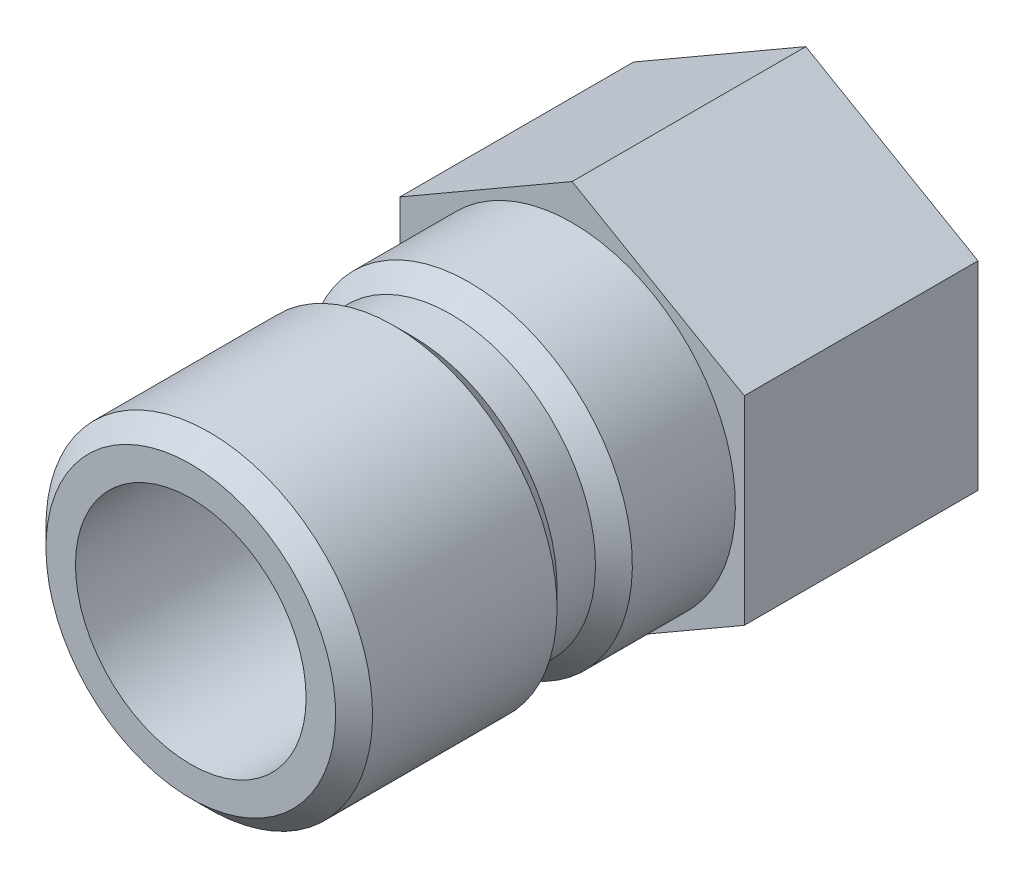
ISO-10303-21;
HEADER;
FILE_DESCRIPTION(('STEP AP214'),'2;1');
FILE_NAME('part.step','',(''),(''),'','','');
FILE_SCHEMA(('AUTOMOTIVE_DESIGN { 1 0 10303 214 1 1 1 1 }'));
ENDSEC;
DATA;
#1=APPLICATION_CONTEXT('core data for automotive mechanical design processes');
#2=APPLICATION_PROTOCOL_DEFINITION('international standard','automotive_design',2000,#1);
#3=PRODUCT_CONTEXT('',#1,'mechanical');
#4=PRODUCT('Part','Part','',(#3));
#5=PRODUCT_RELATED_PRODUCT_CATEGORY('part','',(#4));
#6=PRODUCT_DEFINITION_FORMATION('','',#4);
#7=PRODUCT_DEFINITION_CONTEXT('part definition',#1,'design');
#8=PRODUCT_DEFINITION('design','',#6,#7);
#9=PRODUCT_DEFINITION_SHAPE('','',#8);
#10=(LENGTH_UNIT() NAMED_UNIT(*) SI_UNIT(.MILLI.,.METRE.));
#11=(NAMED_UNIT(*) PLANE_ANGLE_UNIT() SI_UNIT($,.RADIAN.));
#12=(NAMED_UNIT(*) SI_UNIT($,.STERADIAN.) SOLID_ANGLE_UNIT());
#13=UNCERTAINTY_MEASURE_WITH_UNIT(LENGTH_MEASURE(1.E-05),#10,'distance_accuracy_value','');
#14=(GEOMETRIC_REPRESENTATION_CONTEXT(3) GLOBAL_UNCERTAINTY_ASSIGNED_CONTEXT((#13)) GLOBAL_UNIT_ASSIGNED_CONTEXT((#10,
#11,#12)) REPRESENTATION_CONTEXT('',''));
#15=CARTESIAN_POINT('',(0.,0.,0.));
#16=DIRECTION('',(0.,0.,1.));
#17=DIRECTION('',(1.,0.,0.));
#18=AXIS2_PLACEMENT_3D('',#15,#16,#17);
#19=CARTESIAN_POINT('',(0.,6.7437,0.));
#20=DIRECTION('',(0.,0.,1.));
#21=DIRECTION('',(0.,-1.,0.));
#22=AXIS2_PLACEMENT_3D('',#19,#20,#21);
#23=PLANE('',#22);
#24=CARTESIAN_POINT('',(0.,0.,0.));
#25=DIRECTION('',(0.,0.,-1.));
#26=DIRECTION('',(0.,1.,0.));
#27=AXIS2_PLACEMENT_3D('',#24,#25,#26);
#28=CIRCLE('',#27,6.7437);
#29=CARTESIAN_POINT('',(0.,6.7437,0.));
#30=VERTEX_POINT('',#29);
#31=EDGE_CURVE('E148',#30,#30,#28,.T.);
#32=ORIENTED_EDGE('',*,*,#31,.T.);
#33=EDGE_LOOP('',(#32));
#34=FACE_BOUND('',#33,.T.);
#35=DIRECTION('',(-0.866025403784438,0.5,0.));
#36=VECTOR('',#35,1.);
#37=CARTESIAN_POINT('',(7.112,4.10611511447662,0.));
#38=LINE('',#37,#36);
#39=CARTESIAN_POINT('',(7.112,4.10611511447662,0.));
#40=VERTEX_POINT('',#39);
#41=CARTESIAN_POINT('',(0.,8.21223022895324,0.));
#42=VERTEX_POINT('',#41);
#43=EDGE_CURVE('E129',#40,#42,#38,.T.);
#44=ORIENTED_EDGE('',*,*,#43,.T.);
#45=DIRECTION('',(-0.866025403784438,-0.5,0.));
#46=VECTOR('',#45,1.);
#47=CARTESIAN_POINT('',(0.,8.21223022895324,0.));
#48=LINE('',#47,#46);
#49=CARTESIAN_POINT('',(-7.112,4.10611511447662,0.));
#50=VERTEX_POINT('',#49);
#51=EDGE_CURVE('E118',#42,#50,#48,.T.);
#52=ORIENTED_EDGE('',*,*,#51,.T.);
#53=DIRECTION('',(0.,-1.,0.));
#54=VECTOR('',#53,1.);
#55=CARTESIAN_POINT('',(-7.112,4.10611511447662,0.));
#56=LINE('',#55,#54);
#57=CARTESIAN_POINT('',(-7.112,-4.10611511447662,0.));
#58=VERTEX_POINT('',#57);
#59=EDGE_CURVE('E121',#50,#58,#56,.T.);
#60=ORIENTED_EDGE('',*,*,#59,.T.);
#61=DIRECTION('',(0.866025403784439,-0.5,0.));
#62=VECTOR('',#61,1.);
#63=CARTESIAN_POINT('',(-7.112,-4.10611511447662,0.));
#64=LINE('',#63,#62);
#65=CARTESIAN_POINT('',(0.,-8.21223022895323,0.));
#66=VERTEX_POINT('',#65);
#67=EDGE_CURVE('E49',#58,#66,#64,.T.);
#68=ORIENTED_EDGE('',*,*,#67,.T.);
#69=DIRECTION('',(0.866025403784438,0.5,0.));
#70=VECTOR('',#69,1.);
#71=CARTESIAN_POINT('',(0.,-8.21223022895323,0.));
#72=LINE('',#71,#70);
#73=CARTESIAN_POINT('',(7.112,-4.10611511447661,0.));
#74=VERTEX_POINT('',#73);
#75=EDGE_CURVE('E94',#66,#74,#72,.T.);
#76=ORIENTED_EDGE('',*,*,#75,.T.);
#77=DIRECTION('',(0.,1.,0.));
#78=VECTOR('',#77,1.);
#79=CARTESIAN_POINT('',(7.112,-4.10611511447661,0.));
#80=LINE('',#79,#78);
#81=EDGE_CURVE('E126',#74,#40,#80,.T.);
#82=ORIENTED_EDGE('',*,*,#81,.T.);
#83=EDGE_LOOP('',(#44,#52,#60,#68,#76,#82));
#84=FACE_BOUND('',#83,.T.);
#85=ADVANCED_FACE('F34',(#34,#84),#23,.T.);
#86=CARTESIAN_POINT('',(0.,8.73125,-9.652));
#87=DIRECTION('',(0.,0.,-1.));
#88=DIRECTION('',(0.,1.,0.));
#89=AXIS2_PLACEMENT_3D('',#86,#87,#88);
#90=PLANE('',#89);
#91=CARTESIAN_POINT('',(0.,0.,-9.652));
#92=DIRECTION('',(0.,0.,-1.));
#93=DIRECTION('',(0.,1.,0.));
#94=AXIS2_PLACEMENT_3D('',#91,#92,#93);
#95=CIRCLE('',#94,4.55334540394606);
#96=CARTESIAN_POINT('',(0.,4.55334540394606,-9.652));
#97=VERTEX_POINT('',#96);
#98=EDGE_CURVE('E145',#97,#97,#95,.T.);
#99=ORIENTED_EDGE('',*,*,#98,.F.);
#100=EDGE_LOOP('',(#99));
#101=FACE_BOUND('',#100,.T.);
#102=DIRECTION('',(0.,-1.,0.));
#103=VECTOR('',#102,1.);
#104=CARTESIAN_POINT('',(-7.112,4.10611511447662,-9.652));
#105=LINE('',#104,#103);
#106=CARTESIAN_POINT('',(-7.112,4.10611511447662,-9.652));
#107=VERTEX_POINT('',#106);
#108=CARTESIAN_POINT('',(-7.112,-4.10611511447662,-9.652));
#109=VERTEX_POINT('',#108);
#110=EDGE_CURVE('E104',#107,#109,#105,.T.);
#111=ORIENTED_EDGE('',*,*,#110,.F.);
#112=DIRECTION('',(-0.866025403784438,-0.5,0.));
#113=VECTOR('',#112,1.);
#114=CARTESIAN_POINT('',(0.,8.21223022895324,-9.652));
#115=LINE('',#114,#113);
#116=CARTESIAN_POINT('',(0.,8.21223022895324,-9.652));
#117=VERTEX_POINT('',#116);
#118=EDGE_CURVE('E57',#117,#107,#115,.T.);
#119=ORIENTED_EDGE('',*,*,#118,.F.);
#120=DIRECTION('',(-0.866025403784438,0.5,0.));
#121=VECTOR('',#120,1.);
#122=CARTESIAN_POINT('',(7.112,4.10611511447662,-9.652));
#123=LINE('',#122,#121);
#124=CARTESIAN_POINT('',(7.112,4.10611511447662,-9.652));
#125=VERTEX_POINT('',#124);
#126=EDGE_CURVE('E111',#125,#117,#123,.T.);
#127=ORIENTED_EDGE('',*,*,#126,.F.);
#128=DIRECTION('',(0.,1.,0.));
#129=VECTOR('',#128,1.);
#130=CARTESIAN_POINT('',(7.112,-4.10611511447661,-9.652));
#131=LINE('',#130,#129);
#132=CARTESIAN_POINT('',(7.112,-4.10611511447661,-9.652));
#133=VERTEX_POINT('',#132);
#134=EDGE_CURVE('E109',#133,#125,#131,.T.);
#135=ORIENTED_EDGE('',*,*,#134,.F.);
#136=DIRECTION('',(0.866025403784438,0.5,0.));
#137=VECTOR('',#136,1.);
#138=CARTESIAN_POINT('',(0.,-8.21223022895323,-9.652));
#139=LINE('',#138,#137);
#140=CARTESIAN_POINT('',(0.,-8.21223022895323,-9.652));
#141=VERTEX_POINT('',#140);
#142=EDGE_CURVE('E91',#141,#133,#139,.T.);
#143=ORIENTED_EDGE('',*,*,#142,.F.);
#144=DIRECTION('',(0.866025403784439,-0.5,0.));
#145=VECTOR('',#144,1.);
#146=CARTESIAN_POINT('',(-7.112,-4.10611511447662,-9.652));
#147=LINE('',#146,#145);
#148=EDGE_CURVE('E99',#109,#141,#147,.T.);
#149=ORIENTED_EDGE('',*,*,#148,.F.);
#150=EDGE_LOOP('',(#111,#119,#127,#135,#143,#149));
#151=FACE_BOUND('',#150,.T.);
#152=ADVANCED_FACE('F106',(#101,#151),#90,.T.);
#153=CARTESIAN_POINT('',(0.,0.,0.));
#154=DIRECTION('',(0.,0.,-1.));
#155=DIRECTION('',(0.,1.,0.));
#156=AXIS2_PLACEMENT_3D('',#153,#154,#155);
#157=CYLINDRICAL_SURFACE('',#156,4.7625);
#158=CARTESIAN_POINT('',(0.,0.,-1.7145));
#159=DIRECTION('',(0.,0.,-1.));
#160=DIRECTION('',(0.,1.,0.));
#161=AXIS2_PLACEMENT_3D('',#158,#159,#160);
#162=CIRCLE('',#161,4.7625);
#163=CARTESIAN_POINT('',(0.,4.7625,-1.7145));
#164=VERTEX_POINT('',#163);
#165=EDGE_CURVE('E134',#164,#164,#162,.T.);
#166=ORIENTED_EDGE('',*,*,#165,.T.);
#167=EDGE_LOOP('',(#166));
#168=FACE_BOUND('',#167,.T.);
#169=CARTESIAN_POINT('',(0.,0.,15.748));
#170=DIRECTION('',(0.,0.,-1.));
#171=DIRECTION('',(0.,1.,0.));
#172=AXIS2_PLACEMENT_3D('',#169,#170,#171);
#173=CIRCLE('',#172,4.7625);
#174=CARTESIAN_POINT('',(0.,4.7625,15.748));
#175=VERTEX_POINT('',#174);
#176=EDGE_CURVE('E12',#175,#175,#173,.T.);
#177=ORIENTED_EDGE('',*,*,#176,.F.);
#178=EDGE_LOOP('',(#177));
#179=FACE_BOUND('',#178,.T.);
#180=ADVANCED_FACE('F36',(#168,#179),#157,.F.);
#181=CARTESIAN_POINT('',(0.,4.7625,15.748));
#182=DIRECTION('',(0.,0.,1.));
#183=DIRECTION('',(0.,-1.,0.));
#184=AXIS2_PLACEMENT_3D('',#181,#182,#183);
#185=PLANE('',#184);
#186=ORIENTED_EDGE('',*,*,#176,.T.);
#187=EDGE_LOOP('',(#186));
#188=FACE_BOUND('',#187,.T.);
#189=CARTESIAN_POINT('',(0.,0.,15.748));
#190=DIRECTION('',(0.,0.,-1.));
#191=DIRECTION('',(0.,1.,0.));
#192=AXIS2_PLACEMENT_3D('',#189,#190,#191);
#193=CIRCLE('',#192,5.9817);
#194=CARTESIAN_POINT('',(0.,5.9817,15.748));
#195=VERTEX_POINT('',#194);
#196=EDGE_CURVE('E42',#195,#195,#193,.T.);
#197=ORIENTED_EDGE('',*,*,#196,.F.);
#198=EDGE_LOOP('',(#197));
#199=FACE_BOUND('',#198,.T.);
#200=ADVANCED_FACE('F171',(#188,#199),#185,.T.);
#201=CARTESIAN_POINT('',(0.,0.,14.986));
#202=DIRECTION('',(0.,0.,-1.));
#203=DIRECTION('',(0.,1.,0.));
#204=AXIS2_PLACEMENT_3D('',#201,#202,#203);
#205=CONICAL_SURFACE('',#204,6.7437,0.785398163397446);
#206=ORIENTED_EDGE('',*,*,#196,.T.);
#207=EDGE_LOOP('',(#206));
#208=FACE_BOUND('',#207,.T.);
#209=CARTESIAN_POINT('',(0.,0.,14.986));
#210=DIRECTION('',(0.,0.,-1.));
#211=DIRECTION('',(0.,1.,0.));
#212=AXIS2_PLACEMENT_3D('',#209,#210,#211);
#213=CIRCLE('',#212,6.7437);
#214=CARTESIAN_POINT('',(0.,6.7437,14.986));
#215=VERTEX_POINT('',#214);
#216=EDGE_CURVE('E163',#215,#215,#213,.T.);
#217=ORIENTED_EDGE('',*,*,#216,.F.);
#218=EDGE_LOOP('',(#217));
#219=FACE_BOUND('',#218,.T.);
#220=ADVANCED_FACE('F168',(#208,#219),#205,.T.);
#221=CARTESIAN_POINT('',(0.,0.,0.));
#222=DIRECTION('',(0.,0.,-1.));
#223=DIRECTION('',(0.,1.,0.));
#224=AXIS2_PLACEMENT_3D('',#221,#222,#223);
#225=CYLINDRICAL_SURFACE('',#224,6.7437);
#226=ORIENTED_EDGE('',*,*,#216,.T.);
#227=EDGE_LOOP('',(#226));
#228=FACE_BOUND('',#227,.T.);
#229=CARTESIAN_POINT('',(0.,0.,7.366));
#230=DIRECTION('',(0.,0.,-1.));
#231=DIRECTION('',(0.,1.,0.));
#232=AXIS2_PLACEMENT_3D('',#229,#230,#231);
#233=CIRCLE('',#232,6.7437);
#234=CARTESIAN_POINT('',(0.,6.7437,7.366));
#235=VERTEX_POINT('',#234);
#236=EDGE_CURVE('E160',#235,#235,#233,.T.);
#237=ORIENTED_EDGE('',*,*,#236,.F.);
#238=EDGE_LOOP('',(#237));
#239=FACE_BOUND('',#238,.T.);
#240=ADVANCED_FACE('F178',(#228,#239),#225,.T.);
#241=CARTESIAN_POINT('',(0.,0.,6.604));
#242=DIRECTION('',(0.,0.,1.));
#243=DIRECTION('',(0.,-1.,0.));
#244=AXIS2_PLACEMENT_3D('',#241,#242,#243);
#245=CONICAL_SURFACE('',#244,5.9817,0.785398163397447);
#246=ORIENTED_EDGE('',*,*,#236,.T.);
#247=EDGE_LOOP('',(#246));
#248=FACE_BOUND('',#247,.T.);
#249=CARTESIAN_POINT('',(0.,0.,6.604));
#250=DIRECTION('',(0.,0.,-1.));
#251=DIRECTION('',(0.,1.,0.));
#252=AXIS2_PLACEMENT_3D('',#249,#250,#251);
#253=CIRCLE('',#252,5.9817);
#254=CARTESIAN_POINT('',(0.,5.9817,6.604));
#255=VERTEX_POINT('',#254);
#256=EDGE_CURVE('E157',#255,#255,#253,.T.);
#257=ORIENTED_EDGE('',*,*,#256,.F.);
#258=EDGE_LOOP('',(#257));
#259=FACE_BOUND('',#258,.T.);
#260=ADVANCED_FACE('F204',(#248,#259),#245,.T.);
#261=CARTESIAN_POINT('',(0.,0.,0.));
#262=DIRECTION('',(0.,0.,-1.));
#263=DIRECTION('',(0.,1.,0.));
#264=AXIS2_PLACEMENT_3D('',#261,#262,#263);
#265=CYLINDRICAL_SURFACE('',#264,5.9817);
#266=ORIENTED_EDGE('',*,*,#256,.T.);
#267=EDGE_LOOP('',(#266));
#268=FACE_BOUND('',#267,.T.);
#269=CARTESIAN_POINT('',(0.,0.,5.0165));
#270=DIRECTION('',(0.,0.,-1.));
#271=DIRECTION('',(0.,1.,0.));
#272=AXIS2_PLACEMENT_3D('',#269,#270,#271);
#273=CIRCLE('',#272,5.9817);
#274=CARTESIAN_POINT('',(0.,5.9817,5.0165));
#275=VERTEX_POINT('',#274);
#276=EDGE_CURVE('E154',#275,#275,#273,.T.);
#277=ORIENTED_EDGE('',*,*,#276,.F.);
#278=EDGE_LOOP('',(#277));
#279=FACE_BOUND('',#278,.T.);
#280=ADVANCED_FACE('F200',(#268,#279),#265,.T.);
#281=CARTESIAN_POINT('',(0.,0.,4.25449999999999));
#282=DIRECTION('',(0.,0.,-1.));
#283=DIRECTION('',(0.,1.,0.));
#284=AXIS2_PLACEMENT_3D('',#281,#282,#283);
#285=CONICAL_SURFACE('',#284,6.7437,0.785398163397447);
#286=ORIENTED_EDGE('',*,*,#276,.T.);
#287=EDGE_LOOP('',(#286));
#288=FACE_BOUND('',#287,.T.);
#289=CARTESIAN_POINT('',(0.,0.,4.25449999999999));
#290=DIRECTION('',(0.,0.,-1.));
#291=DIRECTION('',(0.,1.,0.));
#292=AXIS2_PLACEMENT_3D('',#289,#290,#291);
#293=CIRCLE('',#292,6.7437);
#294=CARTESIAN_POINT('',(0.,6.7437,4.25449999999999));
#295=VERTEX_POINT('',#294);
#296=EDGE_CURVE('E151',#295,#295,#293,.T.);
#297=ORIENTED_EDGE('',*,*,#296,.F.);
#298=EDGE_LOOP('',(#297));
#299=FACE_BOUND('',#298,.T.);
#300=ADVANCED_FACE('F196',(#288,#299),#285,.T.);
#301=CARTESIAN_POINT('',(0.,0.,0.));
#302=DIRECTION('',(0.,0.,-1.));
#303=DIRECTION('',(0.,1.,0.));
#304=AXIS2_PLACEMENT_3D('',#301,#302,#303);
#305=CYLINDRICAL_SURFACE('',#304,6.7437);
#306=ORIENTED_EDGE('',*,*,#296,.T.);
#307=EDGE_LOOP('',(#306));
#308=FACE_BOUND('',#307,.T.);
#309=ORIENTED_EDGE('',*,*,#31,.F.);
#310=EDGE_LOOP('',(#309));
#311=FACE_BOUND('',#310,.T.);
#312=ADVANCED_FACE('F192',(#308,#311),#305,.T.);
#313=CARTESIAN_POINT('',(0.,0.,-1.7145));
#314=DIRECTION('',(0.,0.,-1.));
#315=DIRECTION('',(0.,1.,0.));
#316=AXIS2_PLACEMENT_3D('',#313,#314,#315);
#317=CONICAL_SURFACE('',#316,4.3053,0.0312396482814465);
#318=ORIENTED_EDGE('',*,*,#98,.T.);
#319=EDGE_LOOP('',(#318));
#320=FACE_BOUND('',#319,.T.);
#321=CARTESIAN_POINT('',(0.,0.,-1.7145));
#322=DIRECTION('',(0.,0.,-1.));
#323=DIRECTION('',(0.,1.,0.));
#324=AXIS2_PLACEMENT_3D('',#321,#322,#323);
#325=CIRCLE('',#324,4.3053);
#326=CARTESIAN_POINT('',(0.,4.3053,-1.7145));
#327=VERTEX_POINT('',#326);
#328=EDGE_CURVE('E142',#327,#327,#325,.T.);
#329=ORIENTED_EDGE('',*,*,#328,.F.);
#330=EDGE_LOOP('',(#329));
#331=FACE_BOUND('',#330,.T.);
#332=ADVANCED_FACE('F195',(#320,#331),#317,.F.);
#333=CARTESIAN_POINT('',(0.,4.7625,-1.7145));
#334=DIRECTION('',(0.,0.,1.));
#335=DIRECTION('',(0.,-1.,0.));
#336=AXIS2_PLACEMENT_3D('',#333,#334,#335);
#337=PLANE('',#336);
#338=ORIENTED_EDGE('',*,*,#328,.T.);
#339=EDGE_LOOP('',(#338));
#340=FACE_BOUND('',#339,.T.);
#341=ORIENTED_EDGE('',*,*,#165,.F.);
#342=EDGE_LOOP('',(#341));
#343=FACE_BOUND('',#342,.T.);
#344=ADVANCED_FACE('F248',(#340,#343),#337,.T.);
#345=CARTESIAN_POINT('',(0.,8.21223022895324,-9.652));
#346=DIRECTION('',(-0.5,0.866025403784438,0.));
#347=DIRECTION('',(-0.866025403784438,-0.5,0.));
#348=AXIS2_PLACEMENT_3D('',#345,#346,#347);
#349=PLANE('',#348);
#350=ORIENTED_EDGE('',*,*,#51,.F.);
#351=DIRECTION('',(0.,0.,1.));
#352=VECTOR('',#351,1.);
#353=CARTESIAN_POINT('',(0.,8.21223022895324,-9.652));
#354=LINE('',#353,#352);
#355=EDGE_CURVE('E132',#117,#42,#354,.T.);
#356=ORIENTED_EDGE('',*,*,#355,.F.);
#357=ORIENTED_EDGE('',*,*,#118,.T.);
#358=DIRECTION('',(0.,0.,1.));
#359=VECTOR('',#358,1.);
#360=CARTESIAN_POINT('',(-7.112,4.10611511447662,-9.652));
#361=LINE('',#360,#359);
#362=EDGE_CURVE('E117',#107,#50,#361,.T.);
#363=ORIENTED_EDGE('',*,*,#362,.T.);
#364=EDGE_LOOP('',(#350,#356,#357,#363));
#365=FACE_BOUND('',#364,.T.);
#366=ADVANCED_FACE('F255',(#365),#349,.T.);
#367=CARTESIAN_POINT('',(7.112,4.10611511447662,-9.652));
#368=DIRECTION('',(0.5,0.866025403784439,0.));
#369=DIRECTION('',(-0.866025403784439,0.5,0.));
#370=AXIS2_PLACEMENT_3D('',#367,#368,#369);
#371=PLANE('',#370);
#372=ORIENTED_EDGE('',*,*,#43,.F.);
#373=DIRECTION('',(0.,0.,1.));
#374=VECTOR('',#373,1.);
#375=CARTESIAN_POINT('',(7.112,4.10611511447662,-9.652));
#376=LINE('',#375,#374);
#377=EDGE_CURVE('E135',#125,#40,#376,.T.);
#378=ORIENTED_EDGE('',*,*,#377,.F.);
#379=ORIENTED_EDGE('',*,*,#126,.T.);
#380=ORIENTED_EDGE('',*,*,#355,.T.);
#381=EDGE_LOOP('',(#372,#378,#379,#380));
#382=FACE_BOUND('',#381,.T.);
#383=ADVANCED_FACE('F263',(#382),#371,.T.);
#384=CARTESIAN_POINT('',(7.112,-4.10611511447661,-9.652));
#385=DIRECTION('',(1.,0.,0.));
#386=DIRECTION('',(0.,1.,0.));
#387=AXIS2_PLACEMENT_3D('',#384,#385,#386);
#388=PLANE('',#387);
#389=ORIENTED_EDGE('',*,*,#81,.F.);
#390=DIRECTION('',(0.,0.,1.));
#391=VECTOR('',#390,1.);
#392=CARTESIAN_POINT('',(7.112,-4.10611511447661,-9.652));
#393=LINE('',#392,#391);
#394=EDGE_CURVE('E95',#133,#74,#393,.T.);
#395=ORIENTED_EDGE('',*,*,#394,.F.);
#396=ORIENTED_EDGE('',*,*,#134,.T.);
#397=ORIENTED_EDGE('',*,*,#377,.T.);
#398=EDGE_LOOP('',(#389,#395,#396,#397));
#399=FACE_BOUND('',#398,.T.);
#400=ADVANCED_FACE('F271',(#399),#388,.T.);
#401=CARTESIAN_POINT('',(0.,-8.21223022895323,-9.652));
#402=DIRECTION('',(0.5,-0.866025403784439,0.));
#403=DIRECTION('',(0.866025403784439,0.5,0.));
#404=AXIS2_PLACEMENT_3D('',#401,#402,#403);
#405=PLANE('',#404);
#406=ORIENTED_EDGE('',*,*,#75,.F.);
#407=DIRECTION('',(0.,0.,1.));
#408=VECTOR('',#407,1.);
#409=CARTESIAN_POINT('',(0.,-8.21223022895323,-9.652));
#410=LINE('',#409,#408);
#411=EDGE_CURVE('E87',#141,#66,#410,.T.);
#412=ORIENTED_EDGE('',*,*,#411,.F.);
#413=ORIENTED_EDGE('',*,*,#142,.T.);
#414=ORIENTED_EDGE('',*,*,#394,.T.);
#415=EDGE_LOOP('',(#406,#412,#413,#414));
#416=FACE_BOUND('',#415,.T.);
#417=ADVANCED_FACE('F89',(#416),#405,.T.);
#418=CARTESIAN_POINT('',(-7.112,-4.10611511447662,-9.652));
#419=DIRECTION('',(-0.5,-0.866025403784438,0.));
#420=DIRECTION('',(0.866025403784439,-0.5,0.));
#421=AXIS2_PLACEMENT_3D('',#418,#419,#420);
#422=PLANE('',#421);
#423=ORIENTED_EDGE('',*,*,#67,.F.);
#424=DIRECTION('',(0.,0.,1.));
#425=VECTOR('',#424,1.);
#426=CARTESIAN_POINT('',(-7.112,-4.10611511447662,-9.652));
#427=LINE('',#426,#425);
#428=EDGE_CURVE('E96',#109,#58,#427,.T.);
#429=ORIENTED_EDGE('',*,*,#428,.F.);
#430=ORIENTED_EDGE('',*,*,#148,.T.);
#431=ORIENTED_EDGE('',*,*,#411,.T.);
#432=EDGE_LOOP('',(#423,#429,#430,#431));
#433=FACE_BOUND('',#432,.T.);
#434=ADVANCED_FACE('F100',(#433),#422,.T.);
#435=CARTESIAN_POINT('',(-7.112,4.10611511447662,-9.652));
#436=DIRECTION('',(-1.,0.,0.));
#437=DIRECTION('',(0.,-1.,0.));
#438=AXIS2_PLACEMENT_3D('',#435,#436,#437);
#439=PLANE('',#438);
#440=ORIENTED_EDGE('',*,*,#59,.F.);
#441=ORIENTED_EDGE('',*,*,#362,.F.);
#442=ORIENTED_EDGE('',*,*,#110,.T.);
#443=ORIENTED_EDGE('',*,*,#428,.T.);
#444=EDGE_LOOP('',(#440,#441,#442,#443));
#445=FACE_BOUND('',#444,.T.);
#446=ADVANCED_FACE('F292',(#445),#439,.T.);
#447=CLOSED_SHELL('',(#85,#152,#180,#200,#220,#240,#260,#280,#300,#312,#332,#344,#366,#383,#400,
#417,#434,#446));
#448=MANIFOLD_SOLID_BREP('B2',#447);
#449=ADVANCED_BREP_SHAPE_REPRESENTATION('',(#18,#448),#14);
#450=SHAPE_DEFINITION_REPRESENTATION(#9,#449);
ENDSEC;
END-ISO-10303-21;
